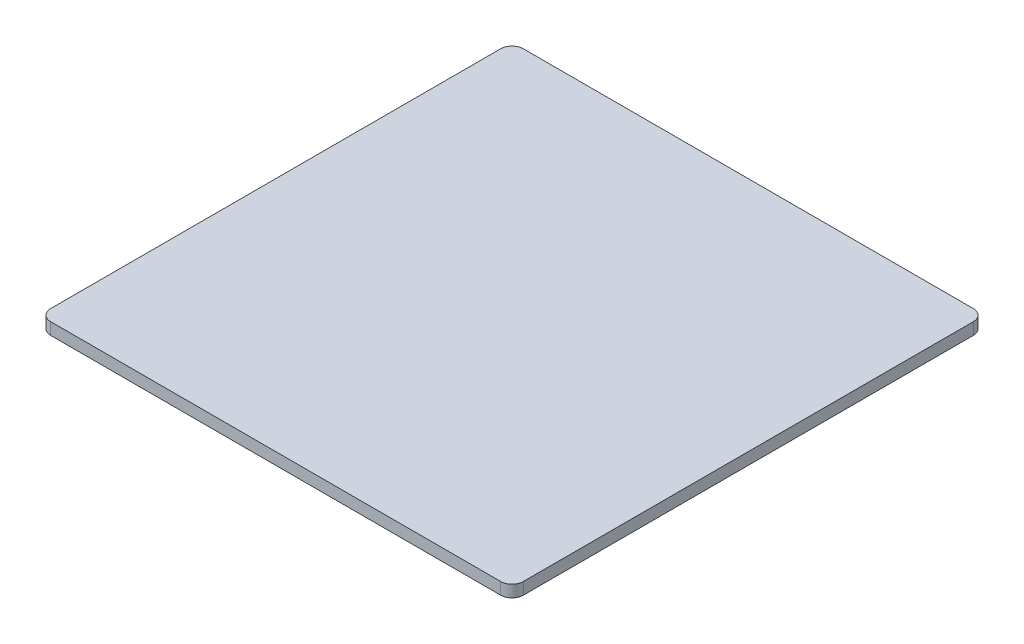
ISO-10303-21;
HEADER;
FILE_DESCRIPTION(('STEP AP214'),'2;1');
FILE_NAME('part.step','',(''),(''),'','','');
FILE_SCHEMA(('AUTOMOTIVE_DESIGN { 1 0 10303 214 1 1 1 1 }'));
ENDSEC;
DATA;
#1=APPLICATION_CONTEXT('core data for automotive mechanical design processes');
#2=APPLICATION_PROTOCOL_DEFINITION('international standard','automotive_design',2000,#1);
#3=PRODUCT_CONTEXT('',#1,'mechanical');
#4=PRODUCT('Part','Part','',(#3));
#5=PRODUCT_RELATED_PRODUCT_CATEGORY('part','',(#4));
#6=PRODUCT_DEFINITION_FORMATION('','',#4);
#7=PRODUCT_DEFINITION_CONTEXT('part definition',#1,'design');
#8=PRODUCT_DEFINITION('design','',#6,#7);
#9=PRODUCT_DEFINITION_SHAPE('','',#8);
#10=(LENGTH_UNIT() NAMED_UNIT(*) SI_UNIT(.MILLI.,.METRE.));
#11=(NAMED_UNIT(*) PLANE_ANGLE_UNIT() SI_UNIT($,.RADIAN.));
#12=(NAMED_UNIT(*) SI_UNIT($,.STERADIAN.) SOLID_ANGLE_UNIT());
#13=UNCERTAINTY_MEASURE_WITH_UNIT(LENGTH_MEASURE(1.E-05),#10,'distance_accuracy_value','');
#14=(GEOMETRIC_REPRESENTATION_CONTEXT(3) GLOBAL_UNCERTAINTY_ASSIGNED_CONTEXT((#13)) GLOBAL_UNIT_ASSIGNED_CONTEXT((#10,
#11,#12)) REPRESENTATION_CONTEXT('',''));
#15=CARTESIAN_POINT('',(0.,0.,0.));
#16=DIRECTION('',(0.,0.,1.));
#17=DIRECTION('',(1.,0.,0.));
#18=AXIS2_PLACEMENT_3D('',#15,#16,#17);
#19=CARTESIAN_POINT('',(15.875,0.4,15.875));
#20=DIRECTION('',(-1.,0.,0.));
#21=DIRECTION('',(0.,0.,1.));
#22=AXIS2_PLACEMENT_3D('',#19,#20,#21);
#23=PLANE('',#22);
#24=DIRECTION('',(0.,0.,-1.));
#25=VECTOR('',#24,1.);
#26=CARTESIAN_POINT('',(15.875,-0.4,15.875));
#27=LINE('',#26,#25);
#28=CARTESIAN_POINT('',(15.875,-0.4,15.113));
#29=VERTEX_POINT('',#28);
#30=CARTESIAN_POINT('',(15.875,-0.4,-15.113));
#31=VERTEX_POINT('',#30);
#32=EDGE_CURVE('E128',#29,#31,#27,.T.);
#33=ORIENTED_EDGE('',*,*,#32,.T.);
#34=DIRECTION('',(0.,-1.,0.));
#35=VECTOR('',#34,1.);
#36=CARTESIAN_POINT('',(15.875,0.4,-15.113));
#37=LINE('',#36,#35);
#38=CARTESIAN_POINT('',(15.875,0.4,-15.113));
#39=VERTEX_POINT('',#38);
#40=EDGE_CURVE('E151',#31,#39,#37,.F.);
#41=ORIENTED_EDGE('',*,*,#40,.T.);
#42=DIRECTION('',(0.,0.,-1.));
#43=VECTOR('',#42,1.);
#44=CARTESIAN_POINT('',(15.875,0.4,15.875));
#45=LINE('',#44,#43);
#46=CARTESIAN_POINT('',(15.875,0.4,15.113));
#47=VERTEX_POINT('',#46);
#48=EDGE_CURVE('E126',#47,#39,#45,.T.);
#49=ORIENTED_EDGE('',*,*,#48,.F.);
#50=DIRECTION('',(0.,-1.,0.));
#51=VECTOR('',#50,1.);
#52=CARTESIAN_POINT('',(15.875,0.4,15.113));
#53=LINE('',#52,#51);
#54=EDGE_CURVE('E148',#47,#29,#53,.T.);
#55=ORIENTED_EDGE('',*,*,#54,.T.);
#56=EDGE_LOOP('',(#33,#41,#49,#55));
#57=FACE_BOUND('',#56,.T.);
#58=ADVANCED_FACE('F33',(#57),#23,.F.);
#59=CARTESIAN_POINT('',(-15.875,0.4,-15.875));
#60=DIRECTION('',(0.,0.,1.));
#61=DIRECTION('',(1.,0.,0.));
#62=AXIS2_PLACEMENT_3D('',#59,#60,#61);
#63=PLANE('',#62);
#64=DIRECTION('',(-1.,0.,0.));
#65=VECTOR('',#64,1.);
#66=CARTESIAN_POINT('',(-15.875,-0.4,-15.875));
#67=LINE('',#66,#65);
#68=CARTESIAN_POINT('',(15.113,-0.4,-15.875));
#69=VERTEX_POINT('',#68);
#70=CARTESIAN_POINT('',(-15.113,-0.4,-15.875));
#71=VERTEX_POINT('',#70);
#72=EDGE_CURVE('E124',#69,#71,#67,.T.);
#73=ORIENTED_EDGE('',*,*,#72,.T.);
#74=DIRECTION('',(0.,-1.,0.));
#75=VECTOR('',#74,1.);
#76=CARTESIAN_POINT('',(-15.113,0.4,-15.875));
#77=LINE('',#76,#75);
#78=CARTESIAN_POINT('',(-15.113,0.4,-15.875));
#79=VERTEX_POINT('',#78);
#80=EDGE_CURVE('E103',#71,#79,#77,.F.);
#81=ORIENTED_EDGE('',*,*,#80,.T.);
#82=DIRECTION('',(-1.,0.,0.));
#83=VECTOR('',#82,1.);
#84=CARTESIAN_POINT('',(-15.875,0.4,-15.875));
#85=LINE('',#84,#83);
#86=CARTESIAN_POINT('',(15.113,0.4,-15.875));
#87=VERTEX_POINT('',#86);
#88=EDGE_CURVE('E167',#87,#79,#85,.T.);
#89=ORIENTED_EDGE('',*,*,#88,.F.);
#90=DIRECTION('',(0.,-1.,0.));
#91=VECTOR('',#90,1.);
#92=CARTESIAN_POINT('',(15.113,0.4,-15.875));
#93=LINE('',#92,#91);
#94=EDGE_CURVE('E108',#87,#69,#93,.T.);
#95=ORIENTED_EDGE('',*,*,#94,.T.);
#96=EDGE_LOOP('',(#73,#81,#89,#95));
#97=FACE_BOUND('',#96,.T.);
#98=ADVANCED_FACE('F184',(#97),#63,.F.);
#99=CARTESIAN_POINT('',(-15.875,0.4,15.875));
#100=DIRECTION('',(1.,0.,0.));
#101=DIRECTION('',(0.,0.,-1.));
#102=AXIS2_PLACEMENT_3D('',#99,#100,#101);
#103=PLANE('',#102);
#104=DIRECTION('',(0.,0.,1.));
#105=VECTOR('',#104,1.);
#106=CARTESIAN_POINT('',(-15.875,0.4,15.875));
#107=LINE('',#106,#105);
#108=CARTESIAN_POINT('',(-15.875,0.4,-15.113));
#109=VERTEX_POINT('',#108);
#110=CARTESIAN_POINT('',(-15.875,0.4,15.113));
#111=VERTEX_POINT('',#110);
#112=EDGE_CURVE('E117',#109,#111,#107,.T.);
#113=ORIENTED_EDGE('',*,*,#112,.F.);
#114=DIRECTION('',(0.,-1.,0.));
#115=VECTOR('',#114,1.);
#116=CARTESIAN_POINT('',(-15.875,0.4,-15.113));
#117=LINE('',#116,#115);
#118=CARTESIAN_POINT('',(-15.875,-0.4,-15.113));
#119=VERTEX_POINT('',#118);
#120=EDGE_CURVE('E102',#109,#119,#117,.T.);
#121=ORIENTED_EDGE('',*,*,#120,.T.);
#122=DIRECTION('',(0.,0.,1.));
#123=VECTOR('',#122,1.);
#124=CARTESIAN_POINT('',(-15.875,-0.4,15.875));
#125=LINE('',#124,#123);
#126=CARTESIAN_POINT('',(-15.875,-0.4,15.113));
#127=VERTEX_POINT('',#126);
#128=EDGE_CURVE('E115',#119,#127,#125,.T.);
#129=ORIENTED_EDGE('',*,*,#128,.T.);
#130=DIRECTION('',(0.,-1.,0.));
#131=VECTOR('',#130,1.);
#132=CARTESIAN_POINT('',(-15.875,0.4,15.113));
#133=LINE('',#132,#131);
#134=EDGE_CURVE('E119',#127,#111,#133,.F.);
#135=ORIENTED_EDGE('',*,*,#134,.T.);
#136=EDGE_LOOP('',(#113,#121,#129,#135));
#137=FACE_BOUND('',#136,.T.);
#138=ADVANCED_FACE('F114',(#137),#103,.F.);
#139=CARTESIAN_POINT('',(-15.875,0.4,15.875));
#140=DIRECTION('',(0.,0.,-1.));
#141=DIRECTION('',(-1.,0.,0.));
#142=AXIS2_PLACEMENT_3D('',#139,#140,#141);
#143=PLANE('',#142);
#144=DIRECTION('',(1.,0.,0.));
#145=VECTOR('',#144,1.);
#146=CARTESIAN_POINT('',(-15.875,-0.4,15.875));
#147=LINE('',#146,#145);
#148=CARTESIAN_POINT('',(-15.113,-0.4,15.875));
#149=VERTEX_POINT('',#148);
#150=CARTESIAN_POINT('',(15.113,-0.4,15.875));
#151=VERTEX_POINT('',#150);
#152=EDGE_CURVE('E123',#149,#151,#147,.T.);
#153=ORIENTED_EDGE('',*,*,#152,.T.);
#154=DIRECTION('',(0.,-1.,0.));
#155=VECTOR('',#154,1.);
#156=CARTESIAN_POINT('',(15.113,0.4,15.875));
#157=LINE('',#156,#155);
#158=CARTESIAN_POINT('',(15.113,0.4,15.875));
#159=VERTEX_POINT('',#158);
#160=EDGE_CURVE('E11',#151,#159,#157,.F.);
#161=ORIENTED_EDGE('',*,*,#160,.T.);
#162=DIRECTION('',(1.,0.,0.));
#163=VECTOR('',#162,1.);
#164=CARTESIAN_POINT('',(-15.875,0.4,15.875));
#165=LINE('',#164,#163);
#166=CARTESIAN_POINT('',(-15.113,0.4,15.875));
#167=VERTEX_POINT('',#166);
#168=EDGE_CURVE('E132',#167,#159,#165,.T.);
#169=ORIENTED_EDGE('',*,*,#168,.F.);
#170=DIRECTION('',(0.,-1.,0.));
#171=VECTOR('',#170,1.);
#172=CARTESIAN_POINT('',(-15.113,0.4,15.875));
#173=LINE('',#172,#171);
#174=EDGE_CURVE('E41',#167,#149,#173,.T.);
#175=ORIENTED_EDGE('',*,*,#174,.T.);
#176=EDGE_LOOP('',(#153,#161,#169,#175));
#177=FACE_BOUND('',#176,.T.);
#178=ADVANCED_FACE('F154',(#177),#143,.F.);
#179=CARTESIAN_POINT('',(0.,0.4,0.));
#180=DIRECTION('',(0.,-1.,0.));
#181=DIRECTION('',(0.,0.,-1.));
#182=AXIS2_PLACEMENT_3D('',#179,#180,#181);
#183=PLANE('',#182);
#184=ORIENTED_EDGE('',*,*,#88,.T.);
#185=CARTESIAN_POINT('',(-15.113,0.4,-15.113));
#186=DIRECTION('',(0.,-1.,0.));
#187=DIRECTION('',(0.,0.,-1.));
#188=AXIS2_PLACEMENT_3D('',#185,#186,#187);
#189=CIRCLE('',#188,0.762);
#190=EDGE_CURVE('E146',#79,#109,#189,.F.);
#191=ORIENTED_EDGE('',*,*,#190,.T.);
#192=ORIENTED_EDGE('',*,*,#112,.T.);
#193=CARTESIAN_POINT('',(-15.113,0.4,15.113));
#194=DIRECTION('',(0.,-1.,0.));
#195=DIRECTION('',(0.,0.,-1.));
#196=AXIS2_PLACEMENT_3D('',#193,#194,#195);
#197=CIRCLE('',#196,0.762);
#198=EDGE_CURVE('E53',#111,#167,#197,.F.);
#199=ORIENTED_EDGE('',*,*,#198,.T.);
#200=ORIENTED_EDGE('',*,*,#168,.T.);
#201=CARTESIAN_POINT('',(15.113,0.4,15.113));
#202=DIRECTION('',(0.,-1.,0.));
#203=DIRECTION('',(0.,0.,-1.));
#204=AXIS2_PLACEMENT_3D('',#201,#202,#203);
#205=CIRCLE('',#204,0.762);
#206=EDGE_CURVE('E142',#159,#47,#205,.F.);
#207=ORIENTED_EDGE('',*,*,#206,.T.);
#208=ORIENTED_EDGE('',*,*,#48,.T.);
#209=CARTESIAN_POINT('',(15.113,0.4,-15.113));
#210=DIRECTION('',(0.,-1.,0.));
#211=DIRECTION('',(0.,0.,-1.));
#212=AXIS2_PLACEMENT_3D('',#209,#210,#211);
#213=CIRCLE('',#212,0.762);
#214=EDGE_CURVE('E144',#39,#87,#213,.F.);
#215=ORIENTED_EDGE('',*,*,#214,.T.);
#216=EDGE_LOOP('',(#184,#191,#192,#199,#200,#207,#208,#215));
#217=FACE_BOUND('',#216,.T.);
#218=ADVANCED_FACE('F173',(#217),#183,.F.);
#219=CARTESIAN_POINT('',(0.,-0.4,0.));
#220=DIRECTION('',(0.,-1.,0.));
#221=DIRECTION('',(0.,0.,-1.));
#222=AXIS2_PLACEMENT_3D('',#219,#220,#221);
#223=PLANE('',#222);
#224=ORIENTED_EDGE('',*,*,#128,.F.);
#225=CARTESIAN_POINT('',(-15.113,-0.4,-15.113));
#226=DIRECTION('',(0.,-1.,0.));
#227=DIRECTION('',(0.,0.,-1.));
#228=AXIS2_PLACEMENT_3D('',#225,#226,#227);
#229=CIRCLE('',#228,0.762);
#230=EDGE_CURVE('E98',#119,#71,#229,.T.);
#231=ORIENTED_EDGE('',*,*,#230,.T.);
#232=ORIENTED_EDGE('',*,*,#72,.F.);
#233=CARTESIAN_POINT('',(15.113,-0.4,-15.113));
#234=DIRECTION('',(0.,-1.,0.));
#235=DIRECTION('',(0.,0.,-1.));
#236=AXIS2_PLACEMENT_3D('',#233,#234,#235);
#237=CIRCLE('',#236,0.762);
#238=EDGE_CURVE('E109',#69,#31,#237,.T.);
#239=ORIENTED_EDGE('',*,*,#238,.T.);
#240=ORIENTED_EDGE('',*,*,#32,.F.);
#241=CARTESIAN_POINT('',(15.113,-0.4,15.113));
#242=DIRECTION('',(0.,-1.,0.));
#243=DIRECTION('',(0.,0.,-1.));
#244=AXIS2_PLACEMENT_3D('',#241,#242,#243);
#245=CIRCLE('',#244,0.762);
#246=EDGE_CURVE('E135',#29,#151,#245,.T.);
#247=ORIENTED_EDGE('',*,*,#246,.T.);
#248=ORIENTED_EDGE('',*,*,#152,.F.);
#249=CARTESIAN_POINT('',(-15.113,-0.4,15.113));
#250=DIRECTION('',(0.,-1.,0.));
#251=DIRECTION('',(0.,0.,-1.));
#252=AXIS2_PLACEMENT_3D('',#249,#250,#251);
#253=CIRCLE('',#252,0.762);
#254=EDGE_CURVE('E118',#149,#127,#253,.T.);
#255=ORIENTED_EDGE('',*,*,#254,.T.);
#256=EDGE_LOOP('',(#224,#231,#232,#239,#240,#247,#248,#255));
#257=FACE_BOUND('',#256,.T.);
#258=ADVANCED_FACE('F121',(#257),#223,.T.);
#259=CARTESIAN_POINT('',(-15.113,0.4,-15.113));
#260=DIRECTION('',(0.,-1.,0.));
#261=DIRECTION('',(0.,0.,-1.));
#262=AXIS2_PLACEMENT_3D('',#259,#260,#261);
#263=CYLINDRICAL_SURFACE('',#262,0.762);
#264=ORIENTED_EDGE('',*,*,#190,.F.);
#265=ORIENTED_EDGE('',*,*,#80,.F.);
#266=ORIENTED_EDGE('',*,*,#230,.F.);
#267=ORIENTED_EDGE('',*,*,#120,.F.);
#268=EDGE_LOOP('',(#264,#265,#266,#267));
#269=FACE_BOUND('',#268,.T.);
#270=ADVANCED_FACE('F101',(#269),#263,.T.);
#271=CARTESIAN_POINT('',(15.113,0.4,-15.113));
#272=DIRECTION('',(0.,-1.,0.));
#273=DIRECTION('',(0.,0.,-1.));
#274=AXIS2_PLACEMENT_3D('',#271,#272,#273);
#275=CYLINDRICAL_SURFACE('',#274,0.762);
#276=ORIENTED_EDGE('',*,*,#214,.F.);
#277=ORIENTED_EDGE('',*,*,#40,.F.);
#278=ORIENTED_EDGE('',*,*,#238,.F.);
#279=ORIENTED_EDGE('',*,*,#94,.F.);
#280=EDGE_LOOP('',(#276,#277,#278,#279));
#281=FACE_BOUND('',#280,.T.);
#282=ADVANCED_FACE('F195',(#281),#275,.T.);
#283=CARTESIAN_POINT('',(15.113,0.4,15.113));
#284=DIRECTION('',(0.,-1.,0.));
#285=DIRECTION('',(0.,0.,-1.));
#286=AXIS2_PLACEMENT_3D('',#283,#284,#285);
#287=CYLINDRICAL_SURFACE('',#286,0.762);
#288=ORIENTED_EDGE('',*,*,#206,.F.);
#289=ORIENTED_EDGE('',*,*,#160,.F.);
#290=ORIENTED_EDGE('',*,*,#246,.F.);
#291=ORIENTED_EDGE('',*,*,#54,.F.);
#292=EDGE_LOOP('',(#288,#289,#290,#291));
#293=FACE_BOUND('',#292,.T.);
#294=ADVANCED_FACE('F161',(#293),#287,.T.);
#295=CARTESIAN_POINT('',(-15.113,0.4,15.113));
#296=DIRECTION('',(0.,-1.,0.));
#297=DIRECTION('',(0.,0.,-1.));
#298=AXIS2_PLACEMENT_3D('',#295,#296,#297);
#299=CYLINDRICAL_SURFACE('',#298,0.762);
#300=ORIENTED_EDGE('',*,*,#198,.F.);
#301=ORIENTED_EDGE('',*,*,#134,.F.);
#302=ORIENTED_EDGE('',*,*,#254,.F.);
#303=ORIENTED_EDGE('',*,*,#174,.F.);
#304=EDGE_LOOP('',(#300,#301,#302,#303));
#305=FACE_BOUND('',#304,.T.);
#306=ADVANCED_FACE('F35',(#305),#299,.T.);
#307=CLOSED_SHELL('',(#58,#98,#138,#178,#218,#258,#270,#282,#294,#306));
#308=MANIFOLD_SOLID_BREP('B2',#307);
#309=ADVANCED_BREP_SHAPE_REPRESENTATION('',(#18,#308),#14);
#310=SHAPE_DEFINITION_REPRESENTATION(#9,#309);
ENDSEC;
END-ISO-10303-21;
